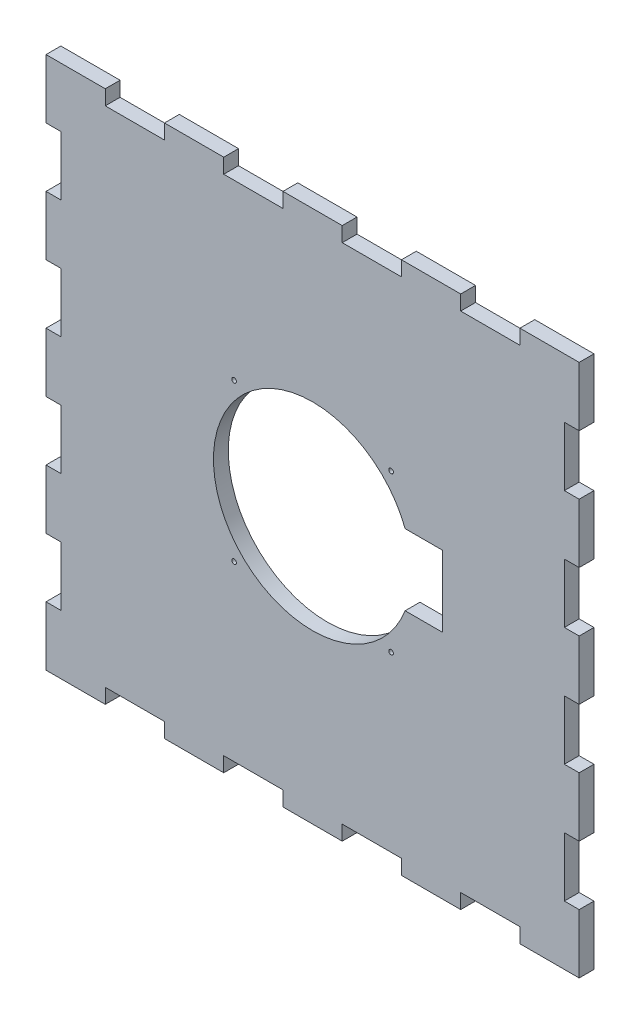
from build123d import *

# Parameters (mm, degrees)
SKETCH1_W               = 114.3
SKETCH1_H               = 114.3
SKETCH1_R               = 21.25
SKETCH1_R_2             = 0.5
BOSS_EXTRUDE1_DEPTH     = 3.175
CUT_EXTRUDE2_START      = -114.3
SKETCH2_W               = 12.7
SKETCH2_H               = 3.175
CUT_EXTRUDE2_DEPTH      = 3.175
CUT_EXTRUDE3_DEPTH      = 128.830720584
CUT_EXTRUDE3_DEPTH_BACK = 3.175
SKETCH2_6_W             = 12.7
SKETCH2_6_H             = 3.175
CUT_EXTRUDE4_DEPTH      = 81.884643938
CUT_EXTRUDE4_DEPTH_BACK = 81.884643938
SKETCH4_W               = 3.175
SKETCH4_H               = 12.7
CUT_EXTRUDE5_DEPTH      = 81.884643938
CUT_EXTRUDE5_DEPTH_BACK = 81.884643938
SKETCH6_W               = 12.7
SKETCH6_H               = 15.24


with BuildPart() as part:
    # Sketch1 → Boss-Extrude1 (new body)
    with BuildSketch(Plane.XY):
        Rectangle(SKETCH1_W, SKETCH1_H)
        Circle(SKETCH1_R, mode=Mode.SUBTRACT)
        with Locations((-16.829141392, 16.829141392)):
            Circle(SKETCH1_R_2, mode=Mode.SUBTRACT)
        with Locations((-16.829141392, -16.829141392)):
            Circle(SKETCH1_R_2, mode=Mode.SUBTRACT)
        with Locations((16.829141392, 16.829141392)):
            Circle(SKETCH1_R_2, mode=Mode.SUBTRACT)
        with Locations((16.829141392, -16.829141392)):
            Circle(SKETCH1_R_2, mode=Mode.SUBTRACT)
    extrude(amount=-BOSS_EXTRUDE1_DEPTH)

    # Sketch2 → Cut-Extrude2 (cut)
    with BuildSketch(Plane(origin=(0, 57.15, 0), x_dir=(1, 0, 0), z_dir=(0, 1, 0)).offset(CUT_EXTRUDE2_START)):
        with Locations((-38.1, 1.5875)):
            Rectangle(SKETCH2_W, SKETCH2_H)
        with Locations((-12.7, 1.5875)):
            Rectangle(SKETCH2_W, SKETCH2_H)
        with Locations((12.7, 1.5875)):
            Rectangle(SKETCH2_W, SKETCH2_H)
        with Locations((38.1, 1.5875)):
            Rectangle(SKETCH2_W, SKETCH2_H)
    extrude(amount=CUT_EXTRUDE2_DEPTH, mode=Mode.SUBTRACT)

    # Sketch2_6 → Cut-Extrude3 (cut, two sides: drawn at the far end of the back side and taken through both)
    with BuildSketch(Plane(origin=(0, 57.15, 0), x_dir=(1, 0, 0), z_dir=(0, 1, 0)).offset(-CUT_EXTRUDE3_DEPTH_BACK)):
        with Locations((38.1, 1.5875)):
            Rectangle(SKETCH2_6_W, SKETCH2_6_H)
        with Locations((12.7, 1.5875)):
            Rectangle(SKETCH2_6_W, SKETCH2_6_H)
        with Locations((-12.7, 1.5875)):
            Rectangle(SKETCH2_6_W, SKETCH2_6_H)
        with Locations((-38.1, 1.5875)):
            Rectangle(SKETCH2_6_W, SKETCH2_6_H)
    extrude(amount=CUT_EXTRUDE3_DEPTH + CUT_EXTRUDE3_DEPTH_BACK, mode=Mode.SUBTRACT)

    # Sketch4 → Cut-Extrude4 (cut, two sides: drawn at the far end of the back side and taken through both)
    with BuildSketch(Plane.XY.offset(-CUT_EXTRUDE4_DEPTH_BACK)):
        with Locations((-55.5625, 38.1)):
            Rectangle(SKETCH4_W, SKETCH4_H)
        with Locations((-55.5625, 12.7)):
            Rectangle(SKETCH4_W, SKETCH4_H)
        with Locations((-55.5625, -12.7)):
            Rectangle(SKETCH4_W, SKETCH4_H)
        with Locations((-55.5625, -38.1)):
            Rectangle(SKETCH4_W, SKETCH4_H)
        with Locations((55.5625, 38.1)):
            Rectangle(SKETCH4_W, SKETCH4_H)
        with Locations((55.5625, 12.7)):
            Rectangle(SKETCH4_W, SKETCH4_H)
        with Locations((55.5625, -12.7)):
            Rectangle(SKETCH4_W, SKETCH4_H)
        with Locations((55.5625, -38.1)):
            Rectangle(SKETCH4_W, SKETCH4_H)
    extrude(amount=CUT_EXTRUDE4_DEPTH + CUT_EXTRUDE4_DEPTH_BACK, mode=Mode.SUBTRACT)

    # Sketch6 → Cut-Extrude5 (cut, two sides: drawn at the far end of the back side and taken through both)
    with BuildSketch(Plane.XY.offset(-CUT_EXTRUDE5_DEPTH_BACK)):
        with Locations((21.5, 0)):
            Rectangle(SKETCH6_W, SKETCH6_H)
    extrude(amount=CUT_EXTRUDE5_DEPTH + CUT_EXTRUDE5_DEPTH_BACK, mode=Mode.SUBTRACT)


solid = part.part
